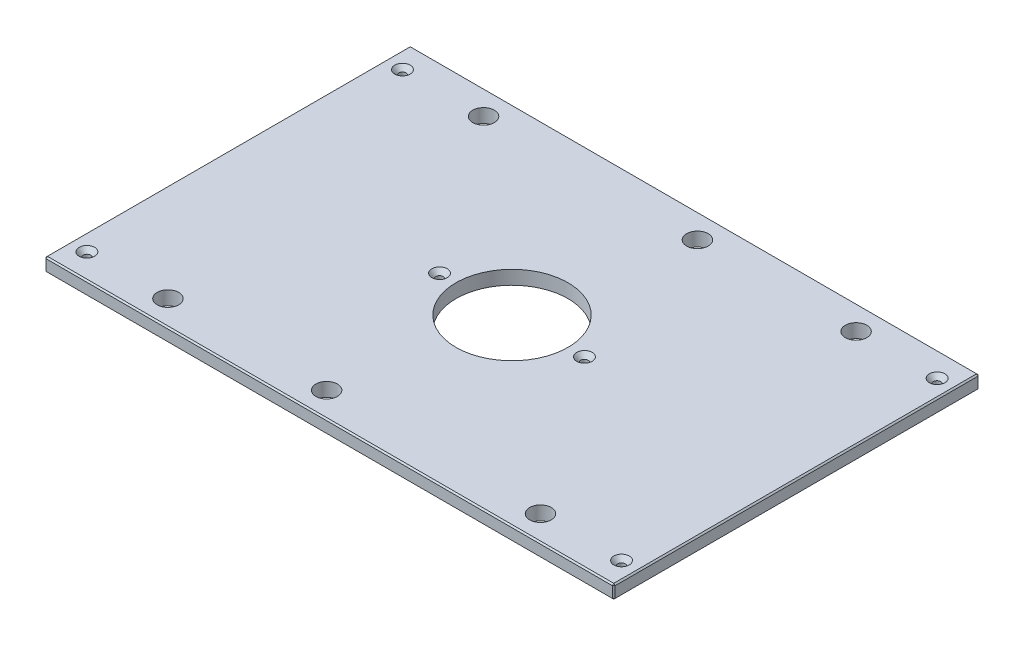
ISO-10303-21;
HEADER;
FILE_DESCRIPTION(('STEP AP214'),'2;1');
FILE_NAME('part.step','',(''),(''),'','','');
FILE_SCHEMA(('AUTOMOTIVE_DESIGN { 1 0 10303 214 1 1 1 1 }'));
ENDSEC;
DATA;
#1=APPLICATION_CONTEXT('core data for automotive mechanical design processes');
#2=APPLICATION_PROTOCOL_DEFINITION('international standard','automotive_design',2000,#1);
#3=PRODUCT_CONTEXT('',#1,'mechanical');
#4=PRODUCT('Part','Part','',(#3));
#5=PRODUCT_RELATED_PRODUCT_CATEGORY('part','',(#4));
#6=PRODUCT_DEFINITION_FORMATION('','',#4);
#7=PRODUCT_DEFINITION_CONTEXT('part definition',#1,'design');
#8=PRODUCT_DEFINITION('design','',#6,#7);
#9=PRODUCT_DEFINITION_SHAPE('','',#8);
#10=(LENGTH_UNIT() NAMED_UNIT(*) SI_UNIT(.MILLI.,.METRE.));
#11=(NAMED_UNIT(*) PLANE_ANGLE_UNIT() SI_UNIT($,.RADIAN.));
#12=(NAMED_UNIT(*) SI_UNIT($,.STERADIAN.) SOLID_ANGLE_UNIT());
#13=UNCERTAINTY_MEASURE_WITH_UNIT(LENGTH_MEASURE(1.E-05),#10,'distance_accuracy_value','');
#14=(GEOMETRIC_REPRESENTATION_CONTEXT(3) GLOBAL_UNCERTAINTY_ASSIGNED_CONTEXT((#13)) GLOBAL_UNIT_ASSIGNED_CONTEXT((#10,
#11,#12)) REPRESENTATION_CONTEXT('',''));
#15=CARTESIAN_POINT('',(0.,0.,0.));
#16=DIRECTION('',(0.,0.,1.));
#17=DIRECTION('',(1.,0.,0.));
#18=AXIS2_PLACEMENT_3D('',#15,#16,#17);
#19=CARTESIAN_POINT('',(-261.9375,12.7,-168.275));
#20=DIRECTION('',(1.,0.,0.));
#21=DIRECTION('',(0.,0.,-1.));
#22=AXIS2_PLACEMENT_3D('',#19,#20,#21);
#23=PLANE('',#22);
#24=DIRECTION('',(0.,0.,-1.));
#25=VECTOR('',#24,1.);
#26=CARTESIAN_POINT('',(-261.9375,11.4299999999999,-168.275));
#27=LINE('',#26,#25);
#28=CARTESIAN_POINT('',(-261.9375,11.4299999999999,167.005));
#29=VERTEX_POINT('',#28);
#30=CARTESIAN_POINT('',(-261.9375,11.4299999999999,-167.005));
#31=VERTEX_POINT('',#30);
#32=EDGE_CURVE('E134',#29,#31,#27,.T.);
#33=ORIENTED_EDGE('',*,*,#32,.T.);
#34=DIRECTION('',(0.,-1.,0.));
#35=VECTOR('',#34,1.);
#36=CARTESIAN_POINT('',(-261.9375,12.7,-167.005));
#37=LINE('',#36,#35);
#38=CARTESIAN_POINT('',(-261.9375,1.27000000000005,-167.005));
#39=VERTEX_POINT('',#38);
#40=EDGE_CURVE('E130',#31,#39,#37,.T.);
#41=ORIENTED_EDGE('',*,*,#40,.T.);
#42=DIRECTION('',(0.,0.,1.));
#43=VECTOR('',#42,1.);
#44=CARTESIAN_POINT('',(-261.9375,1.27000000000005,-168.275));
#45=LINE('',#44,#43);
#46=CARTESIAN_POINT('',(-261.9375,1.27000000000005,167.005));
#47=VERTEX_POINT('',#46);
#48=EDGE_CURVE('E125',#39,#47,#45,.T.);
#49=ORIENTED_EDGE('',*,*,#48,.T.);
#50=DIRECTION('',(0.,1.,0.));
#51=VECTOR('',#50,1.);
#52=CARTESIAN_POINT('',(-261.9375,12.7,167.005));
#53=LINE('',#52,#51);
#54=EDGE_CURVE('E127',#47,#29,#53,.T.);
#55=ORIENTED_EDGE('',*,*,#54,.T.);
#56=EDGE_LOOP('',(#33,#41,#49,#55));
#57=FACE_BOUND('',#56,.T.);
#58=ADVANCED_FACE('F34',(#57),#23,.F.);
#59=CARTESIAN_POINT('',(-261.9375,12.7,168.275));
#60=DIRECTION('',(0.,0.,-1.));
#61=DIRECTION('',(-1.,0.,0.));
#62=AXIS2_PLACEMENT_3D('',#59,#60,#61);
#63=PLANE('',#62);
#64=DIRECTION('',(1.,0.,0.));
#65=VECTOR('',#64,1.);
#66=CARTESIAN_POINT('',(-261.9375,1.27000000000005,168.275));
#67=LINE('',#66,#65);
#68=CARTESIAN_POINT('',(-260.6675,1.27000000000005,168.275));
#69=VERTEX_POINT('',#68);
#70=CARTESIAN_POINT('',(260.6675,1.27000000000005,168.275));
#71=VERTEX_POINT('',#70);
#72=EDGE_CURVE('E57',#69,#71,#67,.T.);
#73=ORIENTED_EDGE('',*,*,#72,.T.);
#74=DIRECTION('',(0.,1.,0.));
#75=VECTOR('',#74,1.);
#76=CARTESIAN_POINT('',(260.6675,12.7,168.275));
#77=LINE('',#76,#75);
#78=CARTESIAN_POINT('',(260.6675,11.4299999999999,168.275));
#79=VERTEX_POINT('',#78);
#80=EDGE_CURVE('E11',#71,#79,#77,.T.);
#81=ORIENTED_EDGE('',*,*,#80,.T.);
#82=DIRECTION('',(-1.,0.,0.));
#83=VECTOR('',#82,1.);
#84=CARTESIAN_POINT('',(-261.9375,11.4299999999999,168.275));
#85=LINE('',#84,#83);
#86=CARTESIAN_POINT('',(-260.6675,11.4299999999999,168.275));
#87=VERTEX_POINT('',#86);
#88=EDGE_CURVE('E43',#79,#87,#85,.T.);
#89=ORIENTED_EDGE('',*,*,#88,.T.);
#90=DIRECTION('',(0.,-1.,0.));
#91=VECTOR('',#90,1.);
#92=CARTESIAN_POINT('',(-260.6675,12.7,168.275));
#93=LINE('',#92,#91);
#94=EDGE_CURVE('E290',#87,#69,#93,.T.);
#95=ORIENTED_EDGE('',*,*,#94,.T.);
#96=EDGE_LOOP('',(#73,#81,#89,#95));
#97=FACE_BOUND('',#96,.T.);
#98=ADVANCED_FACE('F359',(#97),#63,.F.);
#99=CARTESIAN_POINT('',(261.9375,12.7,-168.275));
#100=DIRECTION('',(-1.,0.,0.));
#101=DIRECTION('',(0.,0.,1.));
#102=AXIS2_PLACEMENT_3D('',#99,#100,#101);
#103=PLANE('',#102);
#104=DIRECTION('',(0.,0.,-1.));
#105=VECTOR('',#104,1.);
#106=CARTESIAN_POINT('',(261.9375,1.27000000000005,-168.275));
#107=LINE('',#106,#105);
#108=CARTESIAN_POINT('',(261.9375,1.27000000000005,167.005));
#109=VERTEX_POINT('',#108);
#110=CARTESIAN_POINT('',(261.9375,1.27000000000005,-167.005));
#111=VERTEX_POINT('',#110);
#112=EDGE_CURVE('E285',#109,#111,#107,.T.);
#113=ORIENTED_EDGE('',*,*,#112,.T.);
#114=DIRECTION('',(0.,1.,0.));
#115=VECTOR('',#114,1.);
#116=CARTESIAN_POINT('',(261.9375,12.7,-167.005));
#117=LINE('',#116,#115);
#118=CARTESIAN_POINT('',(261.9375,11.4299999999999,-167.005));
#119=VERTEX_POINT('',#118);
#120=EDGE_CURVE('E287',#111,#119,#117,.T.);
#121=ORIENTED_EDGE('',*,*,#120,.T.);
#122=DIRECTION('',(0.,0.,1.));
#123=VECTOR('',#122,1.);
#124=CARTESIAN_POINT('',(261.9375,11.4299999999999,168.275));
#125=LINE('',#124,#123);
#126=CARTESIAN_POINT('',(261.9375,11.4299999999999,167.005));
#127=VERTEX_POINT('',#126);
#128=EDGE_CURVE('E283',#119,#127,#125,.T.);
#129=ORIENTED_EDGE('',*,*,#128,.T.);
#130=DIRECTION('',(0.,-1.,0.));
#131=VECTOR('',#130,1.);
#132=CARTESIAN_POINT('',(261.9375,12.7,167.005));
#133=LINE('',#132,#131);
#134=EDGE_CURVE('E281',#127,#109,#133,.T.);
#135=ORIENTED_EDGE('',*,*,#134,.T.);
#136=EDGE_LOOP('',(#113,#121,#129,#135));
#137=FACE_BOUND('',#136,.T.);
#138=ADVANCED_FACE('F346',(#137),#103,.F.);
#139=CARTESIAN_POINT('',(-261.9375,12.7,-168.275));
#140=DIRECTION('',(0.,0.,1.));
#141=DIRECTION('',(1.,0.,0.));
#142=AXIS2_PLACEMENT_3D('',#139,#140,#141);
#143=PLANE('',#142);
#144=DIRECTION('',(-1.,0.,0.));
#145=VECTOR('',#144,1.);
#146=CARTESIAN_POINT('',(-261.9375,1.27000000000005,-168.275));
#147=LINE('',#146,#145);
#148=CARTESIAN_POINT('',(260.6675,1.27000000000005,-168.275));
#149=VERTEX_POINT('',#148);
#150=CARTESIAN_POINT('',(-260.6675,1.27000000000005,-168.275));
#151=VERTEX_POINT('',#150);
#152=EDGE_CURVE('E257',#149,#151,#147,.T.);
#153=ORIENTED_EDGE('',*,*,#152,.T.);
#154=DIRECTION('',(0.,1.,0.));
#155=VECTOR('',#154,1.);
#156=CARTESIAN_POINT('',(-260.6675,12.7,-168.275));
#157=LINE('',#156,#155);
#158=CARTESIAN_POINT('',(-260.6675,11.4299999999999,-168.275));
#159=VERTEX_POINT('',#158);
#160=EDGE_CURVE('E261',#151,#159,#157,.T.);
#161=ORIENTED_EDGE('',*,*,#160,.T.);
#162=DIRECTION('',(1.,0.,0.));
#163=VECTOR('',#162,1.);
#164=CARTESIAN_POINT('',(261.9375,11.4299999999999,-168.275));
#165=LINE('',#164,#163);
#166=CARTESIAN_POINT('',(260.6675,11.4299999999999,-168.275));
#167=VERTEX_POINT('',#166);
#168=EDGE_CURVE('E259',#159,#167,#165,.T.);
#169=ORIENTED_EDGE('',*,*,#168,.T.);
#170=DIRECTION('',(0.,-1.,0.));
#171=VECTOR('',#170,1.);
#172=CARTESIAN_POINT('',(260.6675,12.7,-168.275));
#173=LINE('',#172,#171);
#174=EDGE_CURVE('E255',#167,#149,#173,.T.);
#175=ORIENTED_EDGE('',*,*,#174,.T.);
#176=EDGE_LOOP('',(#153,#161,#169,#175));
#177=FACE_BOUND('',#176,.T.);
#178=ADVANCED_FACE('F320',(#177),#143,.F.);
#179=CARTESIAN_POINT('',(0.,12.7,0.));
#180=DIRECTION('',(0.,1.,0.));
#181=DIRECTION('',(0.,0.,1.));
#182=AXIS2_PLACEMENT_3D('',#179,#180,#181);
#183=PLANE('',#182);
#184=CARTESIAN_POINT('',(246.0625,12.7,-145.25498));
#185=DIRECTION('',(0.,1.,0.));
#186=DIRECTION('',(0.,0.,1.));
#187=AXIS2_PLACEMENT_3D('',#184,#185,#186);
#188=CIRCLE('',#187,7.13739999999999);
#189=CARTESIAN_POINT('',(246.0625,12.7,-138.11758));
#190=VERTEX_POINT('',#189);
#191=EDGE_CURVE('E783',#190,#190,#188,.T.);
#192=ORIENTED_EDGE('',*,*,#191,.F.);
#193=EDGE_LOOP('',(#192));
#194=FACE_BOUND('',#193,.T.);
#195=CARTESIAN_POINT('',(246.0625,12.7,145.25498));
#196=DIRECTION('',(0.,1.,0.));
#197=DIRECTION('',(0.,0.,1.));
#198=AXIS2_PLACEMENT_3D('',#195,#196,#197);
#199=CIRCLE('',#198,7.13739999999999);
#200=CARTESIAN_POINT('',(246.0625,12.7,152.39238));
#201=VERTEX_POINT('',#200);
#202=EDGE_CURVE('E787',#201,#201,#199,.T.);
#203=ORIENTED_EDGE('',*,*,#202,.F.);
#204=EDGE_LOOP('',(#203));
#205=FACE_BOUND('',#204,.T.);
#206=CARTESIAN_POINT('',(-246.0625,12.7,145.25498));
#207=DIRECTION('',(0.,1.,0.));
#208=DIRECTION('',(0.,0.,1.));
#209=AXIS2_PLACEMENT_3D('',#206,#207,#208);
#210=CIRCLE('',#209,7.13739999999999);
#211=CARTESIAN_POINT('',(-246.0625,12.7,152.39238));
#212=VERTEX_POINT('',#211);
#213=EDGE_CURVE('E791',#212,#212,#210,.T.);
#214=ORIENTED_EDGE('',*,*,#213,.F.);
#215=EDGE_LOOP('',(#214));
#216=FACE_BOUND('',#215,.T.);
#217=CARTESIAN_POINT('',(-66.675,12.7,0.));
#218=DIRECTION('',(0.,1.,0.));
#219=DIRECTION('',(0.,0.,1.));
#220=AXIS2_PLACEMENT_3D('',#217,#218,#219);
#221=CIRCLE('',#220,7.1374);
#222=CARTESIAN_POINT('',(-66.675,12.7,7.1374));
#223=VERTEX_POINT('',#222);
#224=EDGE_CURVE('E795',#223,#223,#221,.T.);
#225=ORIENTED_EDGE('',*,*,#224,.F.);
#226=EDGE_LOOP('',(#225));
#227=FACE_BOUND('',#226,.T.);
#228=CARTESIAN_POINT('',(66.675,12.7,0.));
#229=DIRECTION('',(0.,1.,0.));
#230=DIRECTION('',(0.,0.,1.));
#231=AXIS2_PLACEMENT_3D('',#228,#229,#230);
#232=CIRCLE('',#231,7.1374);
#233=CARTESIAN_POINT('',(66.675,12.7,7.1374));
#234=VERTEX_POINT('',#233);
#235=EDGE_CURVE('E799',#234,#234,#232,.T.);
#236=ORIENTED_EDGE('',*,*,#235,.F.);
#237=EDGE_LOOP('',(#236));
#238=FACE_BOUND('',#237,.T.);
#239=CARTESIAN_POINT('',(-246.0625,12.7,-145.25498));
#240=DIRECTION('',(0.,1.,0.));
#241=DIRECTION('',(0.,0.,1.));
#242=AXIS2_PLACEMENT_3D('',#239,#240,#241);
#243=CIRCLE('',#242,7.13739999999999);
#244=CARTESIAN_POINT('',(-246.0625,12.7,-138.11758));
#245=VERTEX_POINT('',#244);
#246=EDGE_CURVE('E802',#245,#245,#243,.T.);
#247=ORIENTED_EDGE('',*,*,#246,.F.);
#248=EDGE_LOOP('',(#247));
#249=FACE_BOUND('',#248,.T.);
#250=DIRECTION('',(0.,0.,-1.));
#251=VECTOR('',#250,1.);
#252=CARTESIAN_POINT('',(260.6675,12.7,-168.275));
#253=LINE('',#252,#251);
#254=CARTESIAN_POINT('',(260.6675,12.7,167.005));
#255=VERTEX_POINT('',#254);
#256=CARTESIAN_POINT('',(260.6675,12.7,-167.005));
#257=VERTEX_POINT('',#256);
#258=EDGE_CURVE('E268',#255,#257,#253,.T.);
#259=ORIENTED_EDGE('',*,*,#258,.T.);
#260=DIRECTION('',(-1.,0.,0.));
#261=VECTOR('',#260,1.);
#262=CARTESIAN_POINT('',(-261.9375,12.7,-167.005));
#263=LINE('',#262,#261);
#264=CARTESIAN_POINT('',(-260.6675,12.7,-167.005));
#265=VERTEX_POINT('',#264);
#266=EDGE_CURVE('E270',#257,#265,#263,.T.);
#267=ORIENTED_EDGE('',*,*,#266,.T.);
#268=DIRECTION('',(0.,0.,1.));
#269=VECTOR('',#268,1.);
#270=CARTESIAN_POINT('',(-260.6675,12.7,168.275));
#271=LINE('',#270,#269);
#272=CARTESIAN_POINT('',(-260.6675,12.7,167.005));
#273=VERTEX_POINT('',#272);
#274=EDGE_CURVE('E266',#265,#273,#271,.T.);
#275=ORIENTED_EDGE('',*,*,#274,.T.);
#276=DIRECTION('',(1.,0.,0.));
#277=VECTOR('',#276,1.);
#278=CARTESIAN_POINT('',(261.9375,12.7,167.005));
#279=LINE('',#278,#277);
#280=EDGE_CURVE('E264',#273,#255,#279,.T.);
#281=ORIENTED_EDGE('',*,*,#280,.T.);
#282=EDGE_LOOP('',(#259,#267,#275,#281));
#283=FACE_BOUND('',#282,.T.);
#284=CARTESIAN_POINT('',(171.45,12.7,-145.25498));
#285=DIRECTION('',(0.,1.,0.));
#286=DIRECTION('',(0.,0.,1.));
#287=AXIS2_PLACEMENT_3D('',#284,#285,#286);
#288=CIRCLE('',#287,9.921875);
#289=CARTESIAN_POINT('',(171.45,12.7,-135.333105));
#290=VERTEX_POINT('',#289);
#291=EDGE_CURVE('E203',#290,#290,#288,.T.);
#292=ORIENTED_EDGE('',*,*,#291,.F.);
#293=EDGE_LOOP('',(#292));
#294=FACE_BOUND('',#293,.T.);
#295=CARTESIAN_POINT('',(-171.45,12.7,-145.25498));
#296=DIRECTION('',(0.,1.,0.));
#297=DIRECTION('',(0.,0.,1.));
#298=AXIS2_PLACEMENT_3D('',#295,#296,#297);
#299=CIRCLE('',#298,9.921875);
#300=CARTESIAN_POINT('',(-171.45,12.7,-135.333105));
#301=VERTEX_POINT('',#300);
#302=EDGE_CURVE('E213',#301,#301,#299,.T.);
#303=ORIENTED_EDGE('',*,*,#302,.F.);
#304=EDGE_LOOP('',(#303));
#305=FACE_BOUND('',#304,.T.);
#306=CARTESIAN_POINT('',(171.45,12.7,145.25498));
#307=DIRECTION('',(0.,1.,0.));
#308=DIRECTION('',(0.,0.,1.));
#309=AXIS2_PLACEMENT_3D('',#306,#307,#308);
#310=CIRCLE('',#309,9.921875);
#311=CARTESIAN_POINT('',(171.45,12.7,155.176855));
#312=VERTEX_POINT('',#311);
#313=EDGE_CURVE('E224',#312,#312,#310,.T.);
#314=ORIENTED_EDGE('',*,*,#313,.F.);
#315=EDGE_LOOP('',(#314));
#316=FACE_BOUND('',#315,.T.);
#317=CARTESIAN_POINT('',(-171.45,12.7,145.25498));
#318=DIRECTION('',(0.,1.,0.));
#319=DIRECTION('',(0.,0.,1.));
#320=AXIS2_PLACEMENT_3D('',#317,#318,#319);
#321=CIRCLE('',#320,9.921875);
#322=CARTESIAN_POINT('',(-171.45,12.7,155.176855));
#323=VERTEX_POINT('',#322);
#324=EDGE_CURVE('E230',#323,#323,#321,.T.);
#325=ORIENTED_EDGE('',*,*,#324,.F.);
#326=EDGE_LOOP('',(#325));
#327=FACE_BOUND('',#326,.T.);
#328=CARTESIAN_POINT('',(25.4,12.7,-145.25498));
#329=DIRECTION('',(0.,1.,0.));
#330=DIRECTION('',(0.,0.,1.));
#331=AXIS2_PLACEMENT_3D('',#328,#329,#330);
#332=CIRCLE('',#331,9.921875);
#333=CARTESIAN_POINT('',(25.4,12.7,-135.333105));
#334=VERTEX_POINT('',#333);
#335=EDGE_CURVE('E236',#334,#334,#332,.T.);
#336=ORIENTED_EDGE('',*,*,#335,.F.);
#337=EDGE_LOOP('',(#336));
#338=FACE_BOUND('',#337,.T.);
#339=CARTESIAN_POINT('',(-25.4,12.7,145.25498));
#340=DIRECTION('',(0.,1.,0.));
#341=DIRECTION('',(0.,0.,1.));
#342=AXIS2_PLACEMENT_3D('',#339,#340,#341);
#343=CIRCLE('',#342,9.921875);
#344=CARTESIAN_POINT('',(-25.4,12.7,155.176855));
#345=VERTEX_POINT('',#344);
#346=EDGE_CURVE('E242',#345,#345,#343,.T.);
#347=ORIENTED_EDGE('',*,*,#346,.F.);
#348=EDGE_LOOP('',(#347));
#349=FACE_BOUND('',#348,.T.);
#350=CARTESIAN_POINT('',(0.,12.7,0.));
#351=DIRECTION('',(0.,1.,0.));
#352=DIRECTION('',(0.,0.,1.));
#353=AXIS2_PLACEMENT_3D('',#350,#351,#352);
#354=CIRCLE('',#353,51.562);
#355=CARTESIAN_POINT('',(0.,12.7,51.562));
#356=VERTEX_POINT('',#355);
#357=EDGE_CURVE('E248',#356,#356,#354,.T.);
#358=ORIENTED_EDGE('',*,*,#357,.F.);
#359=EDGE_LOOP('',(#358));
#360=FACE_BOUND('',#359,.T.);
#361=ADVANCED_FACE('F368',(#194,#205,#216,#227,#238,#249,#283,#294,#305,#316,#327,#338,#349,
#360),#183,.T.);
#362=CARTESIAN_POINT('',(0.,0.,0.));
#363=DIRECTION('',(0.,1.,0.));
#364=DIRECTION('',(0.,0.,1.));
#365=AXIS2_PLACEMENT_3D('',#362,#363,#364);
#366=PLANE('',#365);
#367=CARTESIAN_POINT('',(246.0625,0.,-145.25498));
#368=DIRECTION('',(0.,1.,0.));
#369=DIRECTION('',(0.,0.,1.));
#370=AXIS2_PLACEMENT_3D('',#367,#368,#369);
#371=CIRCLE('',#370,3.3782);
#372=CARTESIAN_POINT('',(246.0625,0.,-141.87678));
#373=VERTEX_POINT('',#372);
#374=EDGE_CURVE('E836',#373,#373,#371,.T.);
#375=ORIENTED_EDGE('',*,*,#374,.T.);
#376=EDGE_LOOP('',(#375));
#377=FACE_BOUND('',#376,.T.);
#378=CARTESIAN_POINT('',(246.0625,0.,145.25498));
#379=DIRECTION('',(0.,1.,0.));
#380=DIRECTION('',(0.,0.,1.));
#381=AXIS2_PLACEMENT_3D('',#378,#379,#380);
#382=CIRCLE('',#381,3.3782);
#383=CARTESIAN_POINT('',(246.0625,0.,148.63318));
#384=VERTEX_POINT('',#383);
#385=EDGE_CURVE('E829',#384,#384,#382,.T.);
#386=ORIENTED_EDGE('',*,*,#385,.T.);
#387=EDGE_LOOP('',(#386));
#388=FACE_BOUND('',#387,.T.);
#389=CARTESIAN_POINT('',(-246.0625,0.,145.25498));
#390=DIRECTION('',(0.,1.,0.));
#391=DIRECTION('',(0.,0.,1.));
#392=AXIS2_PLACEMENT_3D('',#389,#390,#391);
#393=CIRCLE('',#392,3.3782);
#394=CARTESIAN_POINT('',(-246.0625,0.,148.63318));
#395=VERTEX_POINT('',#394);
#396=EDGE_CURVE('E822',#395,#395,#393,.T.);
#397=ORIENTED_EDGE('',*,*,#396,.T.);
#398=EDGE_LOOP('',(#397));
#399=FACE_BOUND('',#398,.T.);
#400=CARTESIAN_POINT('',(-66.675,0.,0.));
#401=DIRECTION('',(0.,1.,0.));
#402=DIRECTION('',(0.,0.,1.));
#403=AXIS2_PLACEMENT_3D('',#400,#401,#402);
#404=CIRCLE('',#403,3.3782);
#405=CARTESIAN_POINT('',(-66.675,0.,3.3782));
#406=VERTEX_POINT('',#405);
#407=EDGE_CURVE('E815',#406,#406,#404,.T.);
#408=ORIENTED_EDGE('',*,*,#407,.T.);
#409=EDGE_LOOP('',(#408));
#410=FACE_BOUND('',#409,.T.);
#411=CARTESIAN_POINT('',(66.675,0.,0.));
#412=DIRECTION('',(0.,1.,0.));
#413=DIRECTION('',(0.,0.,1.));
#414=AXIS2_PLACEMENT_3D('',#411,#412,#413);
#415=CIRCLE('',#414,3.3782);
#416=CARTESIAN_POINT('',(66.675,0.,3.3782));
#417=VERTEX_POINT('',#416);
#418=EDGE_CURVE('E805',#417,#417,#415,.T.);
#419=ORIENTED_EDGE('',*,*,#418,.T.);
#420=EDGE_LOOP('',(#419));
#421=FACE_BOUND('',#420,.T.);
#422=CARTESIAN_POINT('',(-246.0625,0.,-145.25498));
#423=DIRECTION('',(0.,1.,0.));
#424=DIRECTION('',(0.,0.,1.));
#425=AXIS2_PLACEMENT_3D('',#422,#423,#424);
#426=CIRCLE('',#425,3.3782);
#427=CARTESIAN_POINT('',(-246.0625,0.,-141.87678));
#428=VERTEX_POINT('',#427);
#429=EDGE_CURVE('E216',#428,#428,#426,.T.);
#430=ORIENTED_EDGE('',*,*,#429,.T.);
#431=EDGE_LOOP('',(#430));
#432=FACE_BOUND('',#431,.T.);
#433=DIRECTION('',(0.,0.,-1.));
#434=VECTOR('',#433,1.);
#435=CARTESIAN_POINT('',(-260.6675,0.,0.));
#436=LINE('',#435,#434);
#437=CARTESIAN_POINT('',(-260.6675,0.,167.005));
#438=VERTEX_POINT('',#437);
#439=CARTESIAN_POINT('',(-260.6675,0.,-167.005));
#440=VERTEX_POINT('',#439);
#441=EDGE_CURVE('E157',#438,#440,#436,.T.);
#442=ORIENTED_EDGE('',*,*,#441,.T.);
#443=DIRECTION('',(1.,0.,0.));
#444=VECTOR('',#443,1.);
#445=CARTESIAN_POINT('',(0.,0.,-167.005));
#446=LINE('',#445,#444);
#447=CARTESIAN_POINT('',(260.6675,0.,-167.005));
#448=VERTEX_POINT('',#447);
#449=EDGE_CURVE('E278',#440,#448,#446,.T.);
#450=ORIENTED_EDGE('',*,*,#449,.T.);
#451=DIRECTION('',(0.,0.,1.));
#452=VECTOR('',#451,1.);
#453=CARTESIAN_POINT('',(260.6675,0.,0.));
#454=LINE('',#453,#452);
#455=CARTESIAN_POINT('',(260.6675,0.,167.005));
#456=VERTEX_POINT('',#455);
#457=EDGE_CURVE('E276',#448,#456,#454,.T.);
#458=ORIENTED_EDGE('',*,*,#457,.T.);
#459=DIRECTION('',(-1.,0.,0.));
#460=VECTOR('',#459,1.);
#461=CARTESIAN_POINT('',(0.,0.,167.005));
#462=LINE('',#461,#460);
#463=EDGE_CURVE('E273',#456,#438,#462,.T.);
#464=ORIENTED_EDGE('',*,*,#463,.T.);
#465=EDGE_LOOP('',(#442,#450,#458,#464));
#466=FACE_BOUND('',#465,.T.);
#467=CARTESIAN_POINT('',(171.45,0.,-145.25498));
#468=DIRECTION('',(0.,1.,0.));
#469=DIRECTION('',(0.,0.,1.));
#470=AXIS2_PLACEMENT_3D('',#467,#468,#469);
#471=CIRCLE('',#470,9.921875);
#472=CARTESIAN_POINT('',(171.45,0.,-135.333105));
#473=VERTEX_POINT('',#472);
#474=EDGE_CURVE('E208',#473,#473,#471,.T.);
#475=ORIENTED_EDGE('',*,*,#474,.T.);
#476=EDGE_LOOP('',(#475));
#477=FACE_BOUND('',#476,.T.);
#478=CARTESIAN_POINT('',(-171.45,0.,-145.25498));
#479=DIRECTION('',(0.,1.,0.));
#480=DIRECTION('',(0.,0.,1.));
#481=AXIS2_PLACEMENT_3D('',#478,#479,#480);
#482=CIRCLE('',#481,9.921875);
#483=CARTESIAN_POINT('',(-171.45,0.,-135.333105));
#484=VERTEX_POINT('',#483);
#485=EDGE_CURVE('E221',#484,#484,#482,.T.);
#486=ORIENTED_EDGE('',*,*,#485,.T.);
#487=EDGE_LOOP('',(#486));
#488=FACE_BOUND('',#487,.T.);
#489=CARTESIAN_POINT('',(171.45,0.,145.25498));
#490=DIRECTION('',(0.,1.,0.));
#491=DIRECTION('',(0.,0.,1.));
#492=AXIS2_PLACEMENT_3D('',#489,#490,#491);
#493=CIRCLE('',#492,9.921875);
#494=CARTESIAN_POINT('',(171.45,0.,155.176855));
#495=VERTEX_POINT('',#494);
#496=EDGE_CURVE('E227',#495,#495,#493,.T.);
#497=ORIENTED_EDGE('',*,*,#496,.T.);
#498=EDGE_LOOP('',(#497));
#499=FACE_BOUND('',#498,.T.);
#500=CARTESIAN_POINT('',(-171.45,0.,145.25498));
#501=DIRECTION('',(0.,1.,0.));
#502=DIRECTION('',(0.,0.,1.));
#503=AXIS2_PLACEMENT_3D('',#500,#501,#502);
#504=CIRCLE('',#503,9.921875);
#505=CARTESIAN_POINT('',(-171.45,0.,155.176855));
#506=VERTEX_POINT('',#505);
#507=EDGE_CURVE('E233',#506,#506,#504,.T.);
#508=ORIENTED_EDGE('',*,*,#507,.T.);
#509=EDGE_LOOP('',(#508));
#510=FACE_BOUND('',#509,.T.);
#511=CARTESIAN_POINT('',(25.4,0.,-145.25498));
#512=DIRECTION('',(0.,1.,0.));
#513=DIRECTION('',(0.,0.,1.));
#514=AXIS2_PLACEMENT_3D('',#511,#512,#513);
#515=CIRCLE('',#514,9.921875);
#516=CARTESIAN_POINT('',(25.4,0.,-135.333105));
#517=VERTEX_POINT('',#516);
#518=EDGE_CURVE('E239',#517,#517,#515,.T.);
#519=ORIENTED_EDGE('',*,*,#518,.T.);
#520=EDGE_LOOP('',(#519));
#521=FACE_BOUND('',#520,.T.);
#522=CARTESIAN_POINT('',(-25.4,0.,145.25498));
#523=DIRECTION('',(0.,1.,0.));
#524=DIRECTION('',(0.,0.,1.));
#525=AXIS2_PLACEMENT_3D('',#522,#523,#524);
#526=CIRCLE('',#525,9.921875);
#527=CARTESIAN_POINT('',(-25.4,0.,155.176855));
#528=VERTEX_POINT('',#527);
#529=EDGE_CURVE('E245',#528,#528,#526,.T.);
#530=ORIENTED_EDGE('',*,*,#529,.T.);
#531=EDGE_LOOP('',(#530));
#532=FACE_BOUND('',#531,.T.);
#533=CARTESIAN_POINT('',(0.,0.,0.));
#534=DIRECTION('',(0.,1.,0.));
#535=DIRECTION('',(0.,0.,1.));
#536=AXIS2_PLACEMENT_3D('',#533,#534,#535);
#537=CIRCLE('',#536,51.562);
#538=CARTESIAN_POINT('',(0.,0.,51.562));
#539=VERTEX_POINT('',#538);
#540=EDGE_CURVE('E146',#539,#539,#537,.T.);
#541=ORIENTED_EDGE('',*,*,#540,.T.);
#542=EDGE_LOOP('',(#541));
#543=FACE_BOUND('',#542,.T.);
#544=ADVANCED_FACE('F333',(#377,#388,#399,#410,#421,#432,#466,#477,#488,#499,#510,#521,#532,
#543),#366,.F.);
#545=CARTESIAN_POINT('',(0.,0.,0.));
#546=DIRECTION('',(0.,1.,0.));
#547=DIRECTION('',(0.,0.,1.));
#548=AXIS2_PLACEMENT_3D('',#545,#546,#547);
#549=CYLINDRICAL_SURFACE('',#548,51.562);
#550=ORIENTED_EDGE('',*,*,#540,.F.);
#551=EDGE_LOOP('',(#550));
#552=FACE_BOUND('',#551,.T.);
#553=ORIENTED_EDGE('',*,*,#357,.T.);
#554=EDGE_LOOP('',(#553));
#555=FACE_BOUND('',#554,.T.);
#556=ADVANCED_FACE('F720',(#552,#555),#549,.F.);
#557=CARTESIAN_POINT('',(-25.4,12.7,145.25498));
#558=DIRECTION('',(0.,1.,0.));
#559=DIRECTION('',(0.,0.,1.));
#560=AXIS2_PLACEMENT_3D('',#557,#558,#559);
#561=CYLINDRICAL_SURFACE('',#560,9.921875);
#562=ORIENTED_EDGE('',*,*,#529,.F.);
#563=EDGE_LOOP('',(#562));
#564=FACE_BOUND('',#563,.T.);
#565=ORIENTED_EDGE('',*,*,#346,.T.);
#566=EDGE_LOOP('',(#565));
#567=FACE_BOUND('',#566,.T.);
#568=ADVANCED_FACE('F711',(#564,#567),#561,.F.);
#569=CARTESIAN_POINT('',(25.4,12.7,-145.25498));
#570=DIRECTION('',(0.,1.,0.));
#571=DIRECTION('',(0.,0.,1.));
#572=AXIS2_PLACEMENT_3D('',#569,#570,#571);
#573=CYLINDRICAL_SURFACE('',#572,9.921875);
#574=ORIENTED_EDGE('',*,*,#518,.F.);
#575=EDGE_LOOP('',(#574));
#576=FACE_BOUND('',#575,.T.);
#577=ORIENTED_EDGE('',*,*,#335,.T.);
#578=EDGE_LOOP('',(#577));
#579=FACE_BOUND('',#578,.T.);
#580=ADVANCED_FACE('F702',(#576,#579),#573,.F.);
#581=CARTESIAN_POINT('',(-171.45,12.7,145.25498));
#582=DIRECTION('',(0.,1.,0.));
#583=DIRECTION('',(0.,0.,1.));
#584=AXIS2_PLACEMENT_3D('',#581,#582,#583);
#585=CYLINDRICAL_SURFACE('',#584,9.921875);
#586=ORIENTED_EDGE('',*,*,#507,.F.);
#587=EDGE_LOOP('',(#586));
#588=FACE_BOUND('',#587,.T.);
#589=ORIENTED_EDGE('',*,*,#324,.T.);
#590=EDGE_LOOP('',(#589));
#591=FACE_BOUND('',#590,.T.);
#592=ADVANCED_FACE('F693',(#588,#591),#585,.F.);
#593=CARTESIAN_POINT('',(171.45,12.7,145.25498));
#594=DIRECTION('',(0.,1.,0.));
#595=DIRECTION('',(0.,0.,1.));
#596=AXIS2_PLACEMENT_3D('',#593,#594,#595);
#597=CYLINDRICAL_SURFACE('',#596,9.921875);
#598=ORIENTED_EDGE('',*,*,#496,.F.);
#599=EDGE_LOOP('',(#598));
#600=FACE_BOUND('',#599,.T.);
#601=ORIENTED_EDGE('',*,*,#313,.T.);
#602=EDGE_LOOP('',(#601));
#603=FACE_BOUND('',#602,.T.);
#604=ADVANCED_FACE('F684',(#600,#603),#597,.F.);
#605=CARTESIAN_POINT('',(-171.45,12.7,-145.25498));
#606=DIRECTION('',(0.,1.,0.));
#607=DIRECTION('',(0.,0.,1.));
#608=AXIS2_PLACEMENT_3D('',#605,#606,#607);
#609=CYLINDRICAL_SURFACE('',#608,9.921875);
#610=ORIENTED_EDGE('',*,*,#485,.F.);
#611=EDGE_LOOP('',(#610));
#612=FACE_BOUND('',#611,.T.);
#613=ORIENTED_EDGE('',*,*,#302,.T.);
#614=EDGE_LOOP('',(#613));
#615=FACE_BOUND('',#614,.T.);
#616=ADVANCED_FACE('F674',(#612,#615),#609,.F.);
#617=CARTESIAN_POINT('',(171.45,12.7,-145.25498));
#618=DIRECTION('',(0.,1.,0.));
#619=DIRECTION('',(0.,0.,1.));
#620=AXIS2_PLACEMENT_3D('',#617,#618,#619);
#621=CYLINDRICAL_SURFACE('',#620,9.921875);
#622=ORIENTED_EDGE('',*,*,#474,.F.);
#623=EDGE_LOOP('',(#622));
#624=FACE_BOUND('',#623,.T.);
#625=ORIENTED_EDGE('',*,*,#291,.T.);
#626=EDGE_LOOP('',(#625));
#627=FACE_BOUND('',#626,.T.);
#628=ADVANCED_FACE('F377',(#624,#627),#621,.F.);
#629=CARTESIAN_POINT('',(261.9375,12.7,167.005));
#630=DIRECTION('',(-0.707106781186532,0.,-0.707106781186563));
#631=DIRECTION('',(0.,-1.,0.));
#632=AXIS2_PLACEMENT_3D('',#629,#630,#631);
#633=PLANE('',#632);
#634=DIRECTION('',(-0.707106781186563,0.,0.707106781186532));
#635=VECTOR('',#634,1.);
#636=CARTESIAN_POINT('',(261.9375,11.4299999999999,167.005));
#637=LINE('',#636,#635);
#638=EDGE_CURVE('E38',#79,#127,#637,.F.);
#639=ORIENTED_EDGE('',*,*,#638,.F.);
#640=ORIENTED_EDGE('',*,*,#80,.F.);
#641=DIRECTION('',(0.707106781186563,0.,-0.707106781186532));
#642=VECTOR('',#641,1.);
#643=CARTESIAN_POINT('',(261.3025,1.27000000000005,167.64));
#644=LINE('',#643,#642);
#645=EDGE_CURVE('E196',#109,#71,#644,.F.);
#646=ORIENTED_EDGE('',*,*,#645,.F.);
#647=ORIENTED_EDGE('',*,*,#134,.F.);
#648=EDGE_LOOP('',(#639,#640,#646,#647));
#649=FACE_BOUND('',#648,.T.);
#650=ADVANCED_FACE('F36',(#649),#633,.F.);
#651=CARTESIAN_POINT('',(261.9375,11.4299999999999,167.005));
#652=DIRECTION('',(0.577350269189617,0.577350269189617,0.577350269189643));
#653=DIRECTION('',(0.707106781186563,0.,-0.707106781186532));
#654=AXIS2_PLACEMENT_3D('',#651,#652,#653);
#655=PLANE('',#654);
#656=DIRECTION('',(0.,-0.707106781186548,0.707106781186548));
#657=VECTOR('',#656,1.);
#658=CARTESIAN_POINT('',(260.6675,12.065,167.64));
#659=LINE('',#658,#657);
#660=EDGE_CURVE('E192',#79,#255,#659,.F.);
#661=ORIENTED_EDGE('',*,*,#660,.F.);
#662=ORIENTED_EDGE('',*,*,#638,.T.);
#663=DIRECTION('',(-0.707106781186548,0.707106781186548,0.));
#664=VECTOR('',#663,1.);
#665=CARTESIAN_POINT('',(261.9375,11.4299999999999,167.005));
#666=LINE('',#665,#664);
#667=EDGE_CURVE('E194',#255,#127,#666,.F.);
#668=ORIENTED_EDGE('',*,*,#667,.F.);
#669=EDGE_LOOP('',(#661,#662,#668));
#670=FACE_BOUND('',#669,.T.);
#671=ADVANCED_FACE('F370',(#670),#655,.T.);
#672=CARTESIAN_POINT('',(260.6675,0.,167.005));
#673=DIRECTION('',(0.577350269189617,-0.577350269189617,0.577350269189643));
#674=DIRECTION('',(0.707106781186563,0.,-0.707106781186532));
#675=AXIS2_PLACEMENT_3D('',#672,#673,#674);
#676=PLANE('',#675);
#677=DIRECTION('',(-0.707106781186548,-0.707106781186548,0.));
#678=VECTOR('',#677,1.);
#679=CARTESIAN_POINT('',(260.6675,0.,167.005));
#680=LINE('',#679,#678);
#681=EDGE_CURVE('E186',#109,#456,#680,.T.);
#682=ORIENTED_EDGE('',*,*,#681,.F.);
#683=ORIENTED_EDGE('',*,*,#645,.T.);
#684=DIRECTION('',(0.,0.707106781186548,0.707106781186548));
#685=VECTOR('',#684,1.);
#686=CARTESIAN_POINT('',(260.6675,0.,167.005));
#687=LINE('',#686,#685);
#688=EDGE_CURVE('E189',#456,#71,#687,.T.);
#689=ORIENTED_EDGE('',*,*,#688,.F.);
#690=EDGE_LOOP('',(#682,#683,#689));
#691=FACE_BOUND('',#690,.T.);
#692=ADVANCED_FACE('F339',(#691),#676,.T.);
#693=CARTESIAN_POINT('',(260.6675,12.7,0.));
#694=DIRECTION('',(0.707106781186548,0.707106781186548,0.));
#695=DIRECTION('',(0.,0.,1.));
#696=AXIS2_PLACEMENT_3D('',#693,#694,#695);
#697=PLANE('',#696);
#698=ORIENTED_EDGE('',*,*,#667,.T.);
#699=ORIENTED_EDGE('',*,*,#128,.F.);
#700=DIRECTION('',(0.707106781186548,-0.707106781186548,0.));
#701=VECTOR('',#700,1.);
#702=CARTESIAN_POINT('',(261.3025,12.065,-167.005));
#703=LINE('',#702,#701);
#704=EDGE_CURVE('E181',#257,#119,#703,.T.);
#705=ORIENTED_EDGE('',*,*,#704,.F.);
#706=ORIENTED_EDGE('',*,*,#258,.F.);
#707=EDGE_LOOP('',(#698,#699,#705,#706));
#708=FACE_BOUND('',#707,.T.);
#709=ADVANCED_FACE('F356',(#708),#697,.T.);
#710=CARTESIAN_POINT('',(0.,12.7,167.005));
#711=DIRECTION('',(0.,0.707106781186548,0.707106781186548));
#712=DIRECTION('',(-1.,0.,0.));
#713=AXIS2_PLACEMENT_3D('',#710,#711,#712);
#714=PLANE('',#713);
#715=ORIENTED_EDGE('',*,*,#660,.T.);
#716=ORIENTED_EDGE('',*,*,#280,.F.);
#717=DIRECTION('',(0.,0.707106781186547,-0.707106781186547));
#718=VECTOR('',#717,1.);
#719=CARTESIAN_POINT('',(-260.6675,12.7,167.005));
#720=LINE('',#719,#718);
#721=EDGE_CURVE('E178',#87,#273,#720,.T.);
#722=ORIENTED_EDGE('',*,*,#721,.F.);
#723=ORIENTED_EDGE('',*,*,#88,.F.);
#724=EDGE_LOOP('',(#715,#716,#722,#723));
#725=FACE_BOUND('',#724,.T.);
#726=ADVANCED_FACE('F361',(#725),#714,.T.);
#727=CARTESIAN_POINT('',(-260.6675,12.7,168.275));
#728=DIRECTION('',(0.707106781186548,0.,-0.707106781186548));
#729=DIRECTION('',(0.,-1.,0.));
#730=AXIS2_PLACEMENT_3D('',#727,#728,#729);
#731=PLANE('',#730);
#732=DIRECTION('',(0.707106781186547,0.,0.707106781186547));
#733=VECTOR('',#732,1.);
#734=CARTESIAN_POINT('',(-261.9375,1.27000000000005,167.005));
#735=LINE('',#734,#733);
#736=EDGE_CURVE('E141',#69,#47,#735,.F.);
#737=ORIENTED_EDGE('',*,*,#736,.F.);
#738=ORIENTED_EDGE('',*,*,#94,.F.);
#739=DIRECTION('',(-0.707106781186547,0.,-0.707106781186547));
#740=VECTOR('',#739,1.);
#741=CARTESIAN_POINT('',(-261.3025,11.4299999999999,167.64));
#742=LINE('',#741,#740);
#743=EDGE_CURVE('E144',#29,#87,#742,.F.);
#744=ORIENTED_EDGE('',*,*,#743,.F.);
#745=ORIENTED_EDGE('',*,*,#54,.F.);
#746=EDGE_LOOP('',(#737,#738,#744,#745));
#747=FACE_BOUND('',#746,.T.);
#748=ADVANCED_FACE('F139',(#747),#731,.F.);
#749=CARTESIAN_POINT('',(-261.9375,1.27000000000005,168.275));
#750=DIRECTION('',(0.,0.707106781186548,-0.707106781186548));
#751=DIRECTION('',(1.,0.,0.));
#752=AXIS2_PLACEMENT_3D('',#749,#750,#751);
#753=PLANE('',#752);
#754=ORIENTED_EDGE('',*,*,#688,.T.);
#755=ORIENTED_EDGE('',*,*,#72,.F.);
#756=DIRECTION('',(0.,-0.707106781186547,-0.707106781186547));
#757=VECTOR('',#756,1.);
#758=CARTESIAN_POINT('',(-260.6675,0.635000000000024,167.64));
#759=LINE('',#758,#757);
#760=EDGE_CURVE('E154',#438,#69,#759,.F.);
#761=ORIENTED_EDGE('',*,*,#760,.F.);
#762=ORIENTED_EDGE('',*,*,#463,.F.);
#763=EDGE_LOOP('',(#754,#755,#761,#762));
#764=FACE_BOUND('',#763,.T.);
#765=ADVANCED_FACE('F338',(#764),#753,.F.);
#766=CARTESIAN_POINT('',(261.9375,1.27000000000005,-168.275));
#767=DIRECTION('',(-0.707106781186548,0.707106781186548,0.));
#768=DIRECTION('',(0.,0.,-1.));
#769=AXIS2_PLACEMENT_3D('',#766,#767,#768);
#770=PLANE('',#769);
#771=ORIENTED_EDGE('',*,*,#681,.T.);
#772=ORIENTED_EDGE('',*,*,#457,.F.);
#773=DIRECTION('',(0.707106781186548,0.707106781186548,0.));
#774=VECTOR('',#773,1.);
#775=CARTESIAN_POINT('',(260.6675,0.,-167.005));
#776=LINE('',#775,#774);
#777=EDGE_CURVE('E173',#111,#448,#776,.F.);
#778=ORIENTED_EDGE('',*,*,#777,.F.);
#779=ORIENTED_EDGE('',*,*,#112,.F.);
#780=EDGE_LOOP('',(#771,#772,#778,#779));
#781=FACE_BOUND('',#780,.T.);
#782=ADVANCED_FACE('F343',(#781),#770,.F.);
#783=CARTESIAN_POINT('',(260.6675,12.7,-168.275));
#784=DIRECTION('',(-0.707106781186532,0.,0.707106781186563));
#785=DIRECTION('',(0.,-1.,0.));
#786=AXIS2_PLACEMENT_3D('',#783,#784,#785);
#787=PLANE('',#786);
#788=DIRECTION('',(0.707106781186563,0.,0.707106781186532));
#789=VECTOR('',#788,1.);
#790=CARTESIAN_POINT('',(260.6675,11.4299999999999,-168.275));
#791=LINE('',#790,#789);
#792=EDGE_CURVE('E183',#119,#167,#791,.F.);
#793=ORIENTED_EDGE('',*,*,#792,.F.);
#794=ORIENTED_EDGE('',*,*,#120,.F.);
#795=DIRECTION('',(-0.707106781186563,0.,-0.707106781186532));
#796=VECTOR('',#795,1.);
#797=CARTESIAN_POINT('',(261.3025,1.27000000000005,-167.64));
#798=LINE('',#797,#796);
#799=EDGE_CURVE('E170',#149,#111,#798,.F.);
#800=ORIENTED_EDGE('',*,*,#799,.F.);
#801=ORIENTED_EDGE('',*,*,#174,.F.);
#802=EDGE_LOOP('',(#793,#794,#800,#801));
#803=FACE_BOUND('',#802,.T.);
#804=ADVANCED_FACE('F351',(#803),#787,.F.);
#805=CARTESIAN_POINT('',(260.6675,11.4299999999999,-168.275));
#806=DIRECTION('',(0.577350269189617,0.577350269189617,-0.577350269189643));
#807=DIRECTION('',(-0.707106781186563,0.,-0.707106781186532));
#808=AXIS2_PLACEMENT_3D('',#805,#806,#807);
#809=PLANE('',#808);
#810=ORIENTED_EDGE('',*,*,#704,.T.);
#811=ORIENTED_EDGE('',*,*,#792,.T.);
#812=DIRECTION('',(0.,0.707106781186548,0.707106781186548));
#813=VECTOR('',#812,1.);
#814=CARTESIAN_POINT('',(260.6675,11.4299999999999,-168.275));
#815=LINE('',#814,#813);
#816=EDGE_CURVE('E162',#257,#167,#815,.F.);
#817=ORIENTED_EDGE('',*,*,#816,.F.);
#818=EDGE_LOOP('',(#810,#811,#817));
#819=FACE_BOUND('',#818,.T.);
#820=ADVANCED_FACE('F409',(#819),#809,.T.);
#821=CARTESIAN_POINT('',(-260.6675,12.7,167.005));
#822=DIRECTION('',(-0.577350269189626,0.577350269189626,0.577350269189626));
#823=DIRECTION('',(0.707106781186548,0.,0.707106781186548));
#824=AXIS2_PLACEMENT_3D('',#821,#822,#823);
#825=PLANE('',#824);
#826=ORIENTED_EDGE('',*,*,#743,.T.);
#827=ORIENTED_EDGE('',*,*,#721,.T.);
#828=DIRECTION('',(-0.707106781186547,-0.707106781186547,0.));
#829=VECTOR('',#828,1.);
#830=CARTESIAN_POINT('',(-260.6675,12.7,167.005));
#831=LINE('',#830,#829);
#832=EDGE_CURVE('E158',#29,#273,#831,.F.);
#833=ORIENTED_EDGE('',*,*,#832,.F.);
#834=EDGE_LOOP('',(#826,#827,#833));
#835=FACE_BOUND('',#834,.T.);
#836=ADVANCED_FACE('F363',(#835),#825,.T.);
#837=CARTESIAN_POINT('',(-261.9375,1.27000000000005,167.005));
#838=DIRECTION('',(-0.577350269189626,-0.577350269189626,0.577350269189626));
#839=DIRECTION('',(0.707106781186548,0.,0.707106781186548));
#840=AXIS2_PLACEMENT_3D('',#837,#838,#839);
#841=PLANE('',#840);
#842=ORIENTED_EDGE('',*,*,#760,.T.);
#843=ORIENTED_EDGE('',*,*,#736,.T.);
#844=DIRECTION('',(-0.707106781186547,0.707106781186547,0.));
#845=VECTOR('',#844,1.);
#846=CARTESIAN_POINT('',(-261.9375,1.27000000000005,167.005));
#847=LINE('',#846,#845);
#848=EDGE_CURVE('E151',#438,#47,#847,.T.);
#849=ORIENTED_EDGE('',*,*,#848,.F.);
#850=EDGE_LOOP('',(#842,#843,#849));
#851=FACE_BOUND('',#850,.T.);
#852=ADVANCED_FACE('F150',(#851),#841,.T.);
#853=CARTESIAN_POINT('',(260.6675,0.,-167.005));
#854=DIRECTION('',(0.577350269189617,-0.577350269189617,-0.577350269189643));
#855=DIRECTION('',(-0.707106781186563,0.,-0.707106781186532));
#856=AXIS2_PLACEMENT_3D('',#853,#854,#855);
#857=PLANE('',#856);
#858=ORIENTED_EDGE('',*,*,#799,.T.);
#859=ORIENTED_EDGE('',*,*,#777,.T.);
#860=DIRECTION('',(0.,-0.707106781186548,0.707106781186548));
#861=VECTOR('',#860,1.);
#862=CARTESIAN_POINT('',(260.6675,0.,-167.005));
#863=LINE('',#862,#861);
#864=EDGE_CURVE('E159',#149,#448,#863,.T.);
#865=ORIENTED_EDGE('',*,*,#864,.F.);
#866=EDGE_LOOP('',(#858,#859,#865));
#867=FACE_BOUND('',#866,.T.);
#868=ADVANCED_FACE('F401',(#867),#857,.T.);
#869=CARTESIAN_POINT('',(0.,12.7,-167.005));
#870=DIRECTION('',(0.,0.707106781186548,-0.707106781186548));
#871=DIRECTION('',(1.,0.,0.));
#872=AXIS2_PLACEMENT_3D('',#869,#870,#871);
#873=PLANE('',#872);
#874=ORIENTED_EDGE('',*,*,#816,.T.);
#875=ORIENTED_EDGE('',*,*,#168,.F.);
#876=DIRECTION('',(0.,-0.707106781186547,-0.707106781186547));
#877=VECTOR('',#876,1.);
#878=CARTESIAN_POINT('',(-260.6675,11.4299999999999,-168.275));
#879=LINE('',#878,#877);
#880=EDGE_CURVE('E164',#265,#159,#879,.T.);
#881=ORIENTED_EDGE('',*,*,#880,.F.);
#882=ORIENTED_EDGE('',*,*,#266,.F.);
#883=EDGE_LOOP('',(#874,#875,#881,#882));
#884=FACE_BOUND('',#883,.T.);
#885=ADVANCED_FACE('F315',(#884),#873,.T.);
#886=CARTESIAN_POINT('',(-260.6675,12.7,0.));
#887=DIRECTION('',(-0.707106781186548,0.707106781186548,0.));
#888=DIRECTION('',(0.,0.,-1.));
#889=AXIS2_PLACEMENT_3D('',#886,#887,#888);
#890=PLANE('',#889);
#891=ORIENTED_EDGE('',*,*,#832,.T.);
#892=ORIENTED_EDGE('',*,*,#274,.F.);
#893=DIRECTION('',(0.707106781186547,0.707106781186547,0.));
#894=VECTOR('',#893,1.);
#895=CARTESIAN_POINT('',(-261.3025,12.065,-167.005));
#896=LINE('',#895,#894);
#897=EDGE_CURVE('E304',#31,#265,#896,.T.);
#898=ORIENTED_EDGE('',*,*,#897,.F.);
#899=ORIENTED_EDGE('',*,*,#32,.F.);
#900=EDGE_LOOP('',(#891,#892,#898,#899));
#901=FACE_BOUND('',#900,.T.);
#902=ADVANCED_FACE('F366',(#901),#890,.T.);
#903=CARTESIAN_POINT('',(-261.9375,1.27000000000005,-168.275));
#904=DIRECTION('',(0.707106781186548,0.707106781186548,0.));
#905=DIRECTION('',(0.,0.,1.));
#906=AXIS2_PLACEMENT_3D('',#903,#904,#905);
#907=PLANE('',#906);
#908=ORIENTED_EDGE('',*,*,#848,.T.);
#909=ORIENTED_EDGE('',*,*,#48,.F.);
#910=DIRECTION('',(0.707106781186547,-0.707106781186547,0.));
#911=VECTOR('',#910,1.);
#912=CARTESIAN_POINT('',(-261.9375,1.27000000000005,-167.005));
#913=LINE('',#912,#911);
#914=EDGE_CURVE('E301',#440,#39,#913,.F.);
#915=ORIENTED_EDGE('',*,*,#914,.F.);
#916=ORIENTED_EDGE('',*,*,#441,.F.);
#917=EDGE_LOOP('',(#908,#909,#915,#916));
#918=FACE_BOUND('',#917,.T.);
#919=ADVANCED_FACE('F156',(#918),#907,.F.);
#920=CARTESIAN_POINT('',(-261.9375,1.27000000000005,-168.275));
#921=DIRECTION('',(0.,0.707106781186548,0.707106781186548));
#922=DIRECTION('',(-1.,0.,0.));
#923=AXIS2_PLACEMENT_3D('',#920,#921,#922);
#924=PLANE('',#923);
#925=ORIENTED_EDGE('',*,*,#864,.T.);
#926=ORIENTED_EDGE('',*,*,#449,.F.);
#927=DIRECTION('',(0.,0.707106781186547,-0.707106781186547));
#928=VECTOR('',#927,1.);
#929=CARTESIAN_POINT('',(-260.6675,0.635000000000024,-167.64));
#930=LINE('',#929,#928);
#931=EDGE_CURVE('E298',#151,#440,#930,.F.);
#932=ORIENTED_EDGE('',*,*,#931,.F.);
#933=ORIENTED_EDGE('',*,*,#152,.F.);
#934=EDGE_LOOP('',(#925,#926,#932,#933));
#935=FACE_BOUND('',#934,.T.);
#936=ADVANCED_FACE('F330',(#935),#924,.F.);
#937=CARTESIAN_POINT('',(-260.6675,11.4299999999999,-168.275));
#938=DIRECTION('',(-0.577350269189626,0.577350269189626,-0.577350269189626));
#939=DIRECTION('',(-0.707106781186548,0.,0.707106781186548));
#940=AXIS2_PLACEMENT_3D('',#937,#938,#939);
#941=PLANE('',#940);
#942=ORIENTED_EDGE('',*,*,#897,.T.);
#943=ORIENTED_EDGE('',*,*,#880,.T.);
#944=DIRECTION('',(0.707106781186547,0.,-0.707106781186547));
#945=VECTOR('',#944,1.);
#946=CARTESIAN_POINT('',(-260.6675,11.4299999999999,-168.275));
#947=LINE('',#946,#945);
#948=EDGE_CURVE('E296',#31,#159,#947,.T.);
#949=ORIENTED_EDGE('',*,*,#948,.F.);
#950=EDGE_LOOP('',(#942,#943,#949));
#951=FACE_BOUND('',#950,.T.);
#952=ADVANCED_FACE('F310',(#951),#941,.T.);
#953=CARTESIAN_POINT('',(-261.9375,1.27000000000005,-167.005));
#954=DIRECTION('',(-0.577350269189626,-0.577350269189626,-0.577350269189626));
#955=DIRECTION('',(-0.707106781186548,0.,0.707106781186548));
#956=AXIS2_PLACEMENT_3D('',#953,#954,#955);
#957=PLANE('',#956);
#958=ORIENTED_EDGE('',*,*,#931,.T.);
#959=ORIENTED_EDGE('',*,*,#914,.T.);
#960=DIRECTION('',(-0.707106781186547,0.,0.707106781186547));
#961=VECTOR('',#960,1.);
#962=CARTESIAN_POINT('',(-261.9375,1.27000000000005,-167.005));
#963=LINE('',#962,#961);
#964=EDGE_CURVE('E294',#151,#39,#963,.T.);
#965=ORIENTED_EDGE('',*,*,#964,.F.);
#966=EDGE_LOOP('',(#958,#959,#965));
#967=FACE_BOUND('',#966,.T.);
#968=ADVANCED_FACE('F327',(#967),#957,.T.);
#969=CARTESIAN_POINT('',(-261.9375,12.7,-167.005));
#970=DIRECTION('',(0.707106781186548,0.,0.707106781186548));
#971=DIRECTION('',(0.,-1.,0.));
#972=AXIS2_PLACEMENT_3D('',#969,#970,#971);
#973=PLANE('',#972);
#974=ORIENTED_EDGE('',*,*,#948,.T.);
#975=ORIENTED_EDGE('',*,*,#160,.F.);
#976=ORIENTED_EDGE('',*,*,#964,.T.);
#977=ORIENTED_EDGE('',*,*,#40,.F.);
#978=EDGE_LOOP('',(#974,#975,#976,#977));
#979=FACE_BOUND('',#978,.T.);
#980=ADVANCED_FACE('F325',(#979),#973,.F.);
#981=CARTESIAN_POINT('',(-246.0625,12.7,-145.25498));
#982=DIRECTION('',(0.,1.,0.));
#983=DIRECTION('',(0.,0.,1.));
#984=AXIS2_PLACEMENT_3D('',#981,#982,#983);
#985=CYLINDRICAL_SURFACE('',#984,3.3782);
#986=ORIENTED_EDGE('',*,*,#429,.F.);
#987=EDGE_LOOP('',(#986));
#988=FACE_BOUND('',#987,.T.);
#989=CARTESIAN_POINT('',(-246.0625,8.37553508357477,-145.25498));
#990=DIRECTION('',(0.,1.,0.));
#991=DIRECTION('',(0.,0.,1.));
#992=AXIS2_PLACEMENT_3D('',#989,#990,#991);
#993=CIRCLE('',#992,3.3782);
#994=CARTESIAN_POINT('',(-246.0625,8.37553508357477,-141.87678));
#995=VERTEX_POINT('',#994);
#996=EDGE_CURVE('E804',#995,#995,#993,.T.);
#997=ORIENTED_EDGE('',*,*,#996,.T.);
#998=EDGE_LOOP('',(#997));
#999=FACE_BOUND('',#998,.T.);
#1000=ADVANCED_FACE('F388',(#988,#999),#985,.F.);
#1001=CARTESIAN_POINT('',(-246.0625,12.7,-145.25498));
#1002=DIRECTION('',(0.,1.,0.));
#1003=DIRECTION('',(0.,0.,1.));
#1004=AXIS2_PLACEMENT_3D('',#1001,#1002,#1003);
#1005=CONICAL_SURFACE('',#1004,7.13739999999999,0.715584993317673);
#1006=ORIENTED_EDGE('',*,*,#996,.F.);
#1007=EDGE_LOOP('',(#1006));
#1008=FACE_BOUND('',#1007,.T.);
#1009=ORIENTED_EDGE('',*,*,#246,.T.);
#1010=EDGE_LOOP('',(#1009));
#1011=FACE_BOUND('',#1010,.T.);
#1012=ADVANCED_FACE('F498',(#1008,#1011),#1005,.F.);
#1013=CARTESIAN_POINT('',(66.675,12.7,0.));
#1014=DIRECTION('',(0.,1.,0.));
#1015=DIRECTION('',(0.,0.,1.));
#1016=AXIS2_PLACEMENT_3D('',#1013,#1014,#1015);
#1017=CYLINDRICAL_SURFACE('',#1016,3.3782);
#1018=ORIENTED_EDGE('',*,*,#418,.F.);
#1019=EDGE_LOOP('',(#1018));
#1020=FACE_BOUND('',#1019,.T.);
#1021=CARTESIAN_POINT('',(66.675,8.37553508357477,0.));
#1022=DIRECTION('',(0.,1.,0.));
#1023=DIRECTION('',(0.,0.,1.));
#1024=AXIS2_PLACEMENT_3D('',#1021,#1022,#1023);
#1025=CIRCLE('',#1024,3.3782);
#1026=CARTESIAN_POINT('',(66.675,8.37553508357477,3.3782));
#1027=VERTEX_POINT('',#1026);
#1028=EDGE_CURVE('E809',#1027,#1027,#1025,.T.);
#1029=ORIENTED_EDGE('',*,*,#1028,.T.);
#1030=EDGE_LOOP('',(#1029));
#1031=FACE_BOUND('',#1030,.T.);
#1032=ADVANCED_FACE('F507',(#1020,#1031),#1017,.F.);
#1033=CARTESIAN_POINT('',(66.675,12.7,0.));
#1034=DIRECTION('',(0.,1.,0.));
#1035=DIRECTION('',(0.,0.,1.));
#1036=AXIS2_PLACEMENT_3D('',#1033,#1034,#1035);
#1037=CONICAL_SURFACE('',#1036,7.1374,0.715584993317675);
#1038=ORIENTED_EDGE('',*,*,#1028,.F.);
#1039=EDGE_LOOP('',(#1038));
#1040=FACE_BOUND('',#1039,.T.);
#1041=ORIENTED_EDGE('',*,*,#235,.T.);
#1042=EDGE_LOOP('',(#1041));
#1043=FACE_BOUND('',#1042,.T.);
#1044=ADVANCED_FACE('F515',(#1040,#1043),#1037,.F.);
#1045=CARTESIAN_POINT('',(-66.675,12.7,0.));
#1046=DIRECTION('',(0.,1.,0.));
#1047=DIRECTION('',(0.,0.,1.));
#1048=AXIS2_PLACEMENT_3D('',#1045,#1046,#1047);
#1049=CYLINDRICAL_SURFACE('',#1048,3.3782);
#1050=ORIENTED_EDGE('',*,*,#407,.F.);
#1051=EDGE_LOOP('',(#1050));
#1052=FACE_BOUND('',#1051,.T.);
#1053=CARTESIAN_POINT('',(-66.675,8.37553508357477,0.));
#1054=DIRECTION('',(0.,1.,0.));
#1055=DIRECTION('',(0.,0.,1.));
#1056=AXIS2_PLACEMENT_3D('',#1053,#1054,#1055);
#1057=CIRCLE('',#1056,3.3782);
#1058=CARTESIAN_POINT('',(-66.675,8.37553508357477,3.3782));
#1059=VERTEX_POINT('',#1058);
#1060=EDGE_CURVE('E818',#1059,#1059,#1057,.T.);
#1061=ORIENTED_EDGE('',*,*,#1060,.T.);
#1062=EDGE_LOOP('',(#1061));
#1063=FACE_BOUND('',#1062,.T.);
#1064=ADVANCED_FACE('F523',(#1052,#1063),#1049,.F.);
#1065=CARTESIAN_POINT('',(-66.675,12.7,0.));
#1066=DIRECTION('',(0.,1.,0.));
#1067=DIRECTION('',(0.,0.,1.));
#1068=AXIS2_PLACEMENT_3D('',#1065,#1066,#1067);
#1069=CONICAL_SURFACE('',#1068,7.1374,0.715584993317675);
#1070=ORIENTED_EDGE('',*,*,#1060,.F.);
#1071=EDGE_LOOP('',(#1070));
#1072=FACE_BOUND('',#1071,.T.);
#1073=ORIENTED_EDGE('',*,*,#224,.T.);
#1074=EDGE_LOOP('',(#1073));
#1075=FACE_BOUND('',#1074,.T.);
#1076=ADVANCED_FACE('F531',(#1072,#1075),#1069,.F.);
#1077=CARTESIAN_POINT('',(-246.0625,12.7,145.25498));
#1078=DIRECTION('',(0.,1.,0.));
#1079=DIRECTION('',(0.,0.,1.));
#1080=AXIS2_PLACEMENT_3D('',#1077,#1078,#1079);
#1081=CYLINDRICAL_SURFACE('',#1080,3.3782);
#1082=ORIENTED_EDGE('',*,*,#396,.F.);
#1083=EDGE_LOOP('',(#1082));
#1084=FACE_BOUND('',#1083,.T.);
#1085=CARTESIAN_POINT('',(-246.0625,8.37553508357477,145.25498));
#1086=DIRECTION('',(0.,1.,0.));
#1087=DIRECTION('',(0.,0.,1.));
#1088=AXIS2_PLACEMENT_3D('',#1085,#1086,#1087);
#1089=CIRCLE('',#1088,3.3782);
#1090=CARTESIAN_POINT('',(-246.0625,8.37553508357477,148.63318));
#1091=VERTEX_POINT('',#1090);
#1092=EDGE_CURVE('E825',#1091,#1091,#1089,.T.);
#1093=ORIENTED_EDGE('',*,*,#1092,.T.);
#1094=EDGE_LOOP('',(#1093));
#1095=FACE_BOUND('',#1094,.T.);
#1096=ADVANCED_FACE('F539',(#1084,#1095),#1081,.F.);
#1097=CARTESIAN_POINT('',(-246.0625,12.7,145.25498));
#1098=DIRECTION('',(0.,1.,0.));
#1099=DIRECTION('',(0.,0.,1.));
#1100=AXIS2_PLACEMENT_3D('',#1097,#1098,#1099);
#1101=CONICAL_SURFACE('',#1100,7.13739999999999,0.715584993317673);
#1102=ORIENTED_EDGE('',*,*,#1092,.F.);
#1103=EDGE_LOOP('',(#1102));
#1104=FACE_BOUND('',#1103,.T.);
#1105=ORIENTED_EDGE('',*,*,#213,.T.);
#1106=EDGE_LOOP('',(#1105));
#1107=FACE_BOUND('',#1106,.T.);
#1108=ADVANCED_FACE('F547',(#1104,#1107),#1101,.F.);
#1109=CARTESIAN_POINT('',(246.0625,12.7,145.25498));
#1110=DIRECTION('',(0.,1.,0.));
#1111=DIRECTION('',(0.,0.,1.));
#1112=AXIS2_PLACEMENT_3D('',#1109,#1110,#1111);
#1113=CYLINDRICAL_SURFACE('',#1112,3.3782);
#1114=ORIENTED_EDGE('',*,*,#385,.F.);
#1115=EDGE_LOOP('',(#1114));
#1116=FACE_BOUND('',#1115,.T.);
#1117=CARTESIAN_POINT('',(246.0625,8.37553508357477,145.25498));
#1118=DIRECTION('',(0.,1.,0.));
#1119=DIRECTION('',(0.,0.,1.));
#1120=AXIS2_PLACEMENT_3D('',#1117,#1118,#1119);
#1121=CIRCLE('',#1120,3.3782);
#1122=CARTESIAN_POINT('',(246.0625,8.37553508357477,148.63318));
#1123=VERTEX_POINT('',#1122);
#1124=EDGE_CURVE('E832',#1123,#1123,#1121,.T.);
#1125=ORIENTED_EDGE('',*,*,#1124,.T.);
#1126=EDGE_LOOP('',(#1125));
#1127=FACE_BOUND('',#1126,.T.);
#1128=ADVANCED_FACE('F555',(#1116,#1127),#1113,.F.);
#1129=CARTESIAN_POINT('',(246.0625,12.7,145.25498));
#1130=DIRECTION('',(0.,1.,0.));
#1131=DIRECTION('',(0.,0.,1.));
#1132=AXIS2_PLACEMENT_3D('',#1129,#1130,#1131);
#1133=CONICAL_SURFACE('',#1132,7.13739999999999,0.715584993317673);
#1134=ORIENTED_EDGE('',*,*,#1124,.F.);
#1135=EDGE_LOOP('',(#1134));
#1136=FACE_BOUND('',#1135,.T.);
#1137=ORIENTED_EDGE('',*,*,#202,.T.);
#1138=EDGE_LOOP('',(#1137));
#1139=FACE_BOUND('',#1138,.T.);
#1140=ADVANCED_FACE('F563',(#1136,#1139),#1133,.F.);
#1141=CARTESIAN_POINT('',(246.0625,12.7,-145.25498));
#1142=DIRECTION('',(0.,1.,0.));
#1143=DIRECTION('',(0.,0.,1.));
#1144=AXIS2_PLACEMENT_3D('',#1141,#1142,#1143);
#1145=CYLINDRICAL_SURFACE('',#1144,3.3782);
#1146=ORIENTED_EDGE('',*,*,#374,.F.);
#1147=EDGE_LOOP('',(#1146));
#1148=FACE_BOUND('',#1147,.T.);
#1149=CARTESIAN_POINT('',(246.0625,8.37553508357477,-145.25498));
#1150=DIRECTION('',(0.,1.,0.));
#1151=DIRECTION('',(0.,0.,1.));
#1152=AXIS2_PLACEMENT_3D('',#1149,#1150,#1151);
#1153=CIRCLE('',#1152,3.3782);
#1154=CARTESIAN_POINT('',(246.0625,8.37553508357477,-141.87678));
#1155=VERTEX_POINT('',#1154);
#1156=EDGE_CURVE('E839',#1155,#1155,#1153,.T.);
#1157=ORIENTED_EDGE('',*,*,#1156,.T.);
#1158=EDGE_LOOP('',(#1157));
#1159=FACE_BOUND('',#1158,.T.);
#1160=ADVANCED_FACE('F571',(#1148,#1159),#1145,.F.);
#1161=CARTESIAN_POINT('',(246.0625,12.7,-145.25498));
#1162=DIRECTION('',(0.,1.,0.));
#1163=DIRECTION('',(0.,0.,1.));
#1164=AXIS2_PLACEMENT_3D('',#1161,#1162,#1163);
#1165=CONICAL_SURFACE('',#1164,7.13739999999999,0.715584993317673);
#1166=ORIENTED_EDGE('',*,*,#1156,.F.);
#1167=EDGE_LOOP('',(#1166));
#1168=FACE_BOUND('',#1167,.T.);
#1169=ORIENTED_EDGE('',*,*,#191,.T.);
#1170=EDGE_LOOP('',(#1169));
#1171=FACE_BOUND('',#1170,.T.);
#1172=ADVANCED_FACE('F579',(#1168,#1171),#1165,.F.);
#1173=CLOSED_SHELL('',(#58,#98,#138,#178,#361,#544,#556,#568,#580,#592,#604,#616,#628,#650,#671,
#692,#709,#726,#748,#765,#782,#804,#820,#836,#852,#868,#885,#902,#919,#936,#952,#968,#980,#1000,
#1012,#1032,#1044,#1064,#1076,#1096,#1108,#1128,#1140,#1160,#1172));
#1174=MANIFOLD_SOLID_BREP('B2',#1173);
#1175=ADVANCED_BREP_SHAPE_REPRESENTATION('',(#18,#1174),#14);
#1176=SHAPE_DEFINITION_REPRESENTATION(#9,#1175);
ENDSEC;
END-ISO-10303-21;
